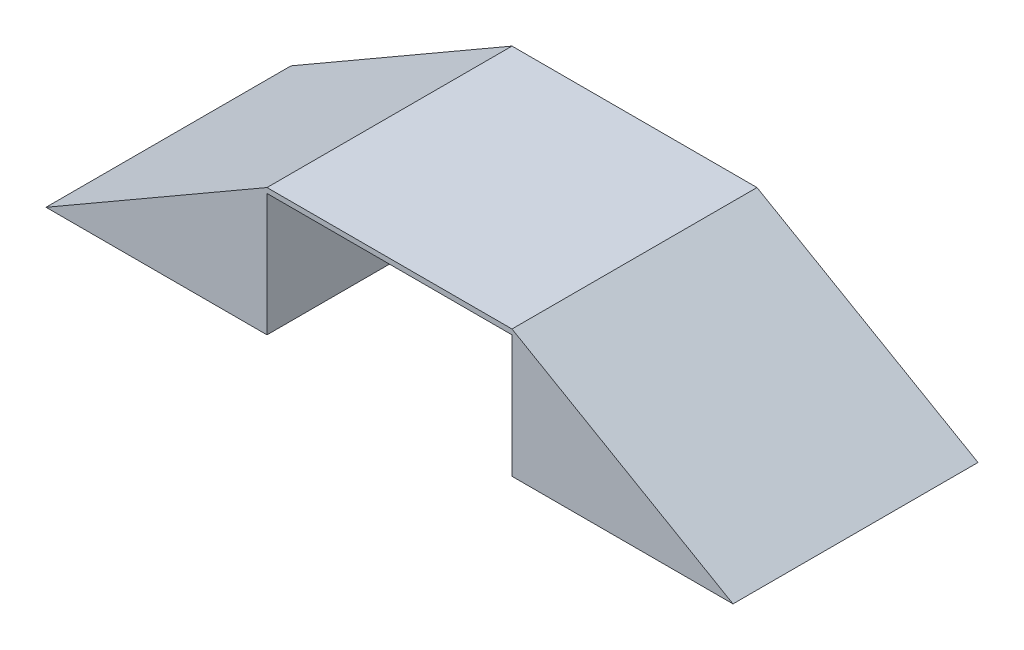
ISO-10303-21;
HEADER;
FILE_DESCRIPTION(('STEP AP214'),'2;1');
FILE_NAME('part.step','',(''),(''),'','','');
FILE_SCHEMA(('AUTOMOTIVE_DESIGN { 1 0 10303 214 1 1 1 1 }'));
ENDSEC;
DATA;
#1=APPLICATION_CONTEXT('core data for automotive mechanical design processes');
#2=APPLICATION_PROTOCOL_DEFINITION('international standard','automotive_design',2000,#1);
#3=PRODUCT_CONTEXT('',#1,'mechanical');
#4=PRODUCT('Part','Part','',(#3));
#5=PRODUCT_RELATED_PRODUCT_CATEGORY('part','',(#4));
#6=PRODUCT_DEFINITION_FORMATION('','',#4);
#7=PRODUCT_DEFINITION_CONTEXT('part definition',#1,'design');
#8=PRODUCT_DEFINITION('design','',#6,#7);
#9=PRODUCT_DEFINITION_SHAPE('','',#8);
#10=(LENGTH_UNIT() NAMED_UNIT(*) SI_UNIT(.MILLI.,.METRE.));
#11=(NAMED_UNIT(*) PLANE_ANGLE_UNIT() SI_UNIT($,.RADIAN.));
#12=(NAMED_UNIT(*) SI_UNIT($,.STERADIAN.) SOLID_ANGLE_UNIT());
#13=UNCERTAINTY_MEASURE_WITH_UNIT(LENGTH_MEASURE(1.E-05),#10,'distance_accuracy_value','');
#14=(GEOMETRIC_REPRESENTATION_CONTEXT(3) GLOBAL_UNCERTAINTY_ASSIGNED_CONTEXT((#13)) GLOBAL_UNIT_ASSIGNED_CONTEXT((#10,
#11,#12)) REPRESENTATION_CONTEXT('',''));
#15=CARTESIAN_POINT('',(0.,0.,0.));
#16=DIRECTION('',(0.,0.,1.));
#17=DIRECTION('',(1.,0.,0.));
#18=AXIS2_PLACEMENT_3D('',#15,#16,#17);
#19=CARTESIAN_POINT('',(854.726131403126,4.71031929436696E-13,304.8));
#20=DIRECTION('',(0.,1.,0.));
#21=DIRECTION('',(-1.,0.,0.));
#22=AXIS2_PLACEMENT_3D('',#19,#20,#21);
#23=PLANE('',#22);
#24=DIRECTION('',(1.,0.,0.));
#25=VECTOR('',#24,1.);
#26=CARTESIAN_POINT('',(854.726131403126,4.71031929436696E-13,-304.8));
#27=LINE('',#26,#25);
#28=CARTESIAN_POINT('',(-854.726131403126,2.61684405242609E-13,-304.8));
#29=VERTEX_POINT('',#28);
#30=CARTESIAN_POINT('',(-304.799999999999,2.61684405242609E-13,-304.8));
#31=VERTEX_POINT('',#30);
#32=EDGE_CURVE('E118',#29,#31,#27,.T.);
#33=ORIENTED_EDGE('',*,*,#32,.T.);
#34=DIRECTION('',(0.,0.,1.));
#35=VECTOR('',#34,1.);
#36=CARTESIAN_POINT('',(-304.799999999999,2.61684405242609E-13,-304.8));
#37=LINE('',#36,#35);
#38=CARTESIAN_POINT('',(-304.799999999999,2.61684405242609E-13,304.8));
#39=VERTEX_POINT('',#38);
#40=EDGE_CURVE('E106',#31,#39,#37,.T.);
#41=ORIENTED_EDGE('',*,*,#40,.T.);
#42=DIRECTION('',(1.,0.,0.));
#43=VECTOR('',#42,1.);
#44=CARTESIAN_POINT('',(854.726131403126,4.71031929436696E-13,304.8));
#45=LINE('',#44,#43);
#46=CARTESIAN_POINT('',(-854.726131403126,2.61684405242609E-13,304.8));
#47=VERTEX_POINT('',#46);
#48=EDGE_CURVE('E84',#47,#39,#45,.T.);
#49=ORIENTED_EDGE('',*,*,#48,.F.);
#50=DIRECTION('',(0.,0.,-1.));
#51=VECTOR('',#50,1.);
#52=CARTESIAN_POINT('',(-854.726131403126,2.61684405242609E-13,304.8));
#53=LINE('',#52,#51);
#54=EDGE_CURVE('E11',#47,#29,#53,.T.);
#55=ORIENTED_EDGE('',*,*,#54,.T.);
#56=EDGE_LOOP('',(#33,#41,#49,#55));
#57=FACE_BOUND('',#56,.T.);
#58=ADVANCED_FACE('F32',(#57),#23,.F.);
#59=CARTESIAN_POINT('',(-854.726131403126,2.61684405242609E-13,304.8));
#60=DIRECTION('',(0.499999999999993,-0.866025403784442,0.));
#61=DIRECTION('',(0.866025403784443,0.499999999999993,0.));
#62=AXIS2_PLACEMENT_3D('',#59,#60,#61);
#63=PLANE('',#62);
#64=DIRECTION('',(-0.866025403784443,-0.499999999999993,0.));
#65=VECTOR('',#64,1.);
#66=CARTESIAN_POINT('',(-854.726131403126,2.61684405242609E-13,-304.8));
#67=LINE('',#66,#65);
#68=CARTESIAN_POINT('',(-304.799999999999,317.499999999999,-304.8));
#69=VERTEX_POINT('',#68);
#70=EDGE_CURVE('E129',#69,#29,#67,.T.);
#71=ORIENTED_EDGE('',*,*,#70,.T.);
#72=ORIENTED_EDGE('',*,*,#54,.F.);
#73=DIRECTION('',(-0.866025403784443,-0.499999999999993,0.));
#74=VECTOR('',#73,1.);
#75=CARTESIAN_POINT('',(-854.726131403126,2.61684405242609E-13,304.8));
#76=LINE('',#75,#74);
#77=CARTESIAN_POINT('',(-304.799999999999,317.499999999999,304.8));
#78=VERTEX_POINT('',#77);
#79=EDGE_CURVE('E134',#78,#47,#76,.T.);
#80=ORIENTED_EDGE('',*,*,#79,.F.);
#81=DIRECTION('',(0.,0.,-1.));
#82=VECTOR('',#81,1.);
#83=CARTESIAN_POINT('',(-304.799999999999,317.499999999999,304.8));
#84=LINE('',#83,#82);
#85=EDGE_CURVE('E135',#78,#69,#84,.T.);
#86=ORIENTED_EDGE('',*,*,#85,.T.);
#87=EDGE_LOOP('',(#71,#72,#80,#86));
#88=FACE_BOUND('',#87,.T.);
#89=ADVANCED_FACE('F34',(#88),#63,.F.);
#90=CARTESIAN_POINT('',(304.800000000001,2.61684405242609E-13,304.8));
#91=VERTEX_POINT('',#90);
#92=CARTESIAN_POINT('',(854.726131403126,4.71031929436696E-13,304.8));
#93=VERTEX_POINT('',#92);
#94=EDGE_CURVE('E160',#91,#93,#45,.T.);
#95=ORIENTED_EDGE('',*,*,#94,.F.);
#96=DIRECTION('',(0.,0.,1.));
#97=VECTOR('',#96,1.);
#98=CARTESIAN_POINT('',(304.800000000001,2.61684405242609E-13,-304.8));
#99=LINE('',#98,#97);
#100=CARTESIAN_POINT('',(304.800000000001,2.61684405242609E-13,-304.8));
#101=VERTEX_POINT('',#100);
#102=EDGE_CURVE('E113',#101,#91,#99,.T.);
#103=ORIENTED_EDGE('',*,*,#102,.F.);
#104=CARTESIAN_POINT('',(854.726131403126,4.71031929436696E-13,-304.8));
#105=VERTEX_POINT('',#104);
#106=EDGE_CURVE('E126',#101,#105,#27,.T.);
#107=ORIENTED_EDGE('',*,*,#106,.T.);
#108=DIRECTION('',(0.,0.,-1.));
#109=VECTOR('',#108,1.);
#110=CARTESIAN_POINT('',(854.726131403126,4.71031929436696E-13,304.8));
#111=LINE('',#110,#109);
#112=EDGE_CURVE('E40',#93,#105,#111,.T.);
#113=ORIENTED_EDGE('',*,*,#112,.F.);
#114=EDGE_LOOP('',(#95,#103,#107,#113));
#115=FACE_BOUND('',#114,.T.);
#116=ADVANCED_FACE('F175',(#115),#23,.F.);
#117=CARTESIAN_POINT('',(304.800000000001,317.499999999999,304.8));
#118=DIRECTION('',(-0.499999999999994,-0.866025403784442,0.));
#119=DIRECTION('',(0.866025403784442,-0.499999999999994,0.));
#120=AXIS2_PLACEMENT_3D('',#117,#118,#119);
#121=PLANE('',#120);
#122=DIRECTION('',(-0.866025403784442,0.499999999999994,0.));
#123=VECTOR('',#122,1.);
#124=CARTESIAN_POINT('',(304.800000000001,317.499999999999,-304.8));
#125=LINE('',#124,#123);
#126=CARTESIAN_POINT('',(304.800000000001,317.499999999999,-304.8));
#127=VERTEX_POINT('',#126);
#128=EDGE_CURVE('E125',#105,#127,#125,.T.);
#129=ORIENTED_EDGE('',*,*,#128,.T.);
#130=DIRECTION('',(0.,0.,-1.));
#131=VECTOR('',#130,1.);
#132=CARTESIAN_POINT('',(304.800000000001,317.499999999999,304.8));
#133=LINE('',#132,#131);
#134=CARTESIAN_POINT('',(304.800000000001,317.499999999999,304.8));
#135=VERTEX_POINT('',#134);
#136=EDGE_CURVE('E137',#135,#127,#133,.T.);
#137=ORIENTED_EDGE('',*,*,#136,.F.);
#138=DIRECTION('',(-0.866025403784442,0.499999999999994,0.));
#139=VECTOR('',#138,1.);
#140=CARTESIAN_POINT('',(304.800000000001,317.499999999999,304.8));
#141=LINE('',#140,#139);
#142=EDGE_CURVE('E145',#93,#135,#141,.T.);
#143=ORIENTED_EDGE('',*,*,#142,.F.);
#144=ORIENTED_EDGE('',*,*,#112,.T.);
#145=EDGE_LOOP('',(#129,#137,#143,#144));
#146=FACE_BOUND('',#145,.T.);
#147=ADVANCED_FACE('F143',(#146),#121,.F.);
#148=CARTESIAN_POINT('',(-304.799999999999,317.499999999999,304.8));
#149=DIRECTION('',(0.,-1.,0.));
#150=DIRECTION('',(1.,0.,0.));
#151=AXIS2_PLACEMENT_3D('',#148,#149,#150);
#152=PLANE('',#151);
#153=DIRECTION('',(-1.,0.,0.));
#154=VECTOR('',#153,1.);
#155=CARTESIAN_POINT('',(-304.799999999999,317.499999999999,-304.8));
#156=LINE('',#155,#154);
#157=EDGE_CURVE('E77',#127,#69,#156,.T.);
#158=ORIENTED_EDGE('',*,*,#157,.T.);
#159=ORIENTED_EDGE('',*,*,#85,.F.);
#160=DIRECTION('',(-1.,0.,0.));
#161=VECTOR('',#160,1.);
#162=CARTESIAN_POINT('',(-304.799999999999,317.499999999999,304.8));
#163=LINE('',#162,#161);
#164=EDGE_CURVE('E56',#135,#78,#163,.T.);
#165=ORIENTED_EDGE('',*,*,#164,.F.);
#166=ORIENTED_EDGE('',*,*,#136,.T.);
#167=EDGE_LOOP('',(#158,#159,#165,#166));
#168=FACE_BOUND('',#167,.T.);
#169=ADVANCED_FACE('F164',(#168),#152,.F.);
#170=CARTESIAN_POINT('',(0.,0.,304.8));
#171=DIRECTION('',(0.,0.,-1.));
#172=DIRECTION('',(-1.,0.,0.));
#173=AXIS2_PLACEMENT_3D('',#170,#171,#172);
#174=PLANE('',#173);
#175=ORIENTED_EDGE('',*,*,#48,.T.);
#176=DIRECTION('',(0.,-1.,0.));
#177=VECTOR('',#176,1.);
#178=CARTESIAN_POINT('',(-304.799999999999,2.61684405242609E-13,304.8));
#179=LINE('',#178,#177);
#180=CARTESIAN_POINT('',(-304.799999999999,304.799999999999,304.8));
#181=VERTEX_POINT('',#180);
#182=EDGE_CURVE('E111',#181,#39,#179,.T.);
#183=ORIENTED_EDGE('',*,*,#182,.F.);
#184=DIRECTION('',(-1.,0.,0.));
#185=VECTOR('',#184,1.);
#186=CARTESIAN_POINT('',(-304.799999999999,304.799999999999,304.8));
#187=LINE('',#186,#185);
#188=CARTESIAN_POINT('',(304.800000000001,304.799999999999,304.8));
#189=VERTEX_POINT('',#188);
#190=EDGE_CURVE('E121',#189,#181,#187,.T.);
#191=ORIENTED_EDGE('',*,*,#190,.F.);
#192=DIRECTION('',(0.,1.,0.));
#193=VECTOR('',#192,1.);
#194=CARTESIAN_POINT('',(304.800000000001,2.61684405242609E-13,304.8));
#195=LINE('',#194,#193);
#196=EDGE_CURVE('E167',#91,#189,#195,.T.);
#197=ORIENTED_EDGE('',*,*,#196,.F.);
#198=ORIENTED_EDGE('',*,*,#94,.T.);
#199=ORIENTED_EDGE('',*,*,#142,.T.);
#200=ORIENTED_EDGE('',*,*,#164,.T.);
#201=ORIENTED_EDGE('',*,*,#79,.T.);
#202=EDGE_LOOP('',(#175,#183,#191,#197,#198,#199,#200,#201));
#203=FACE_BOUND('',#202,.T.);
#204=ADVANCED_FACE('F162',(#203),#174,.F.);
#205=CARTESIAN_POINT('',(0.,0.,-304.8));
#206=DIRECTION('',(0.,0.,-1.));
#207=DIRECTION('',(-1.,0.,0.));
#208=AXIS2_PLACEMENT_3D('',#205,#206,#207);
#209=PLANE('',#208);
#210=DIRECTION('',(0.,-1.,0.));
#211=VECTOR('',#210,1.);
#212=CARTESIAN_POINT('',(-304.799999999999,2.61684405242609E-13,-304.8));
#213=LINE('',#212,#211);
#214=CARTESIAN_POINT('',(-304.799999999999,304.799999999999,-304.8));
#215=VERTEX_POINT('',#214);
#216=EDGE_CURVE('E109',#215,#31,#213,.T.);
#217=ORIENTED_EDGE('',*,*,#216,.T.);
#218=ORIENTED_EDGE('',*,*,#32,.F.);
#219=ORIENTED_EDGE('',*,*,#70,.F.);
#220=ORIENTED_EDGE('',*,*,#157,.F.);
#221=ORIENTED_EDGE('',*,*,#128,.F.);
#222=ORIENTED_EDGE('',*,*,#106,.F.);
#223=DIRECTION('',(0.,1.,0.));
#224=VECTOR('',#223,1.);
#225=CARTESIAN_POINT('',(304.800000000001,2.61684405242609E-13,-304.8));
#226=LINE('',#225,#224);
#227=CARTESIAN_POINT('',(304.800000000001,304.799999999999,-304.8));
#228=VERTEX_POINT('',#227);
#229=EDGE_CURVE('E120',#101,#228,#226,.T.);
#230=ORIENTED_EDGE('',*,*,#229,.T.);
#231=DIRECTION('',(-1.,0.,0.));
#232=VECTOR('',#231,1.);
#233=CARTESIAN_POINT('',(-304.799999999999,304.799999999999,-304.8));
#234=LINE('',#233,#232);
#235=EDGE_CURVE('E47',#228,#215,#234,.T.);
#236=ORIENTED_EDGE('',*,*,#235,.T.);
#237=EDGE_LOOP('',(#217,#218,#219,#220,#221,#222,#230,#236));
#238=FACE_BOUND('',#237,.T.);
#239=ADVANCED_FACE('F116',(#238),#209,.T.);
#240=CARTESIAN_POINT('',(-304.799999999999,2.61684405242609E-13,-304.8));
#241=DIRECTION('',(-1.,0.,0.));
#242=DIRECTION('',(0.,0.,1.));
#243=AXIS2_PLACEMENT_3D('',#240,#241,#242);
#244=PLANE('',#243);
#245=ORIENTED_EDGE('',*,*,#182,.T.);
#246=ORIENTED_EDGE('',*,*,#40,.F.);
#247=ORIENTED_EDGE('',*,*,#216,.F.);
#248=DIRECTION('',(0.,0.,1.));
#249=VECTOR('',#248,1.);
#250=CARTESIAN_POINT('',(-304.799999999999,304.799999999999,-304.8));
#251=LINE('',#250,#249);
#252=EDGE_CURVE('E150',#215,#181,#251,.T.);
#253=ORIENTED_EDGE('',*,*,#252,.T.);
#254=EDGE_LOOP('',(#245,#246,#247,#253));
#255=FACE_BOUND('',#254,.T.);
#256=ADVANCED_FACE('F108',(#255),#244,.F.);
#257=CARTESIAN_POINT('',(-304.799999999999,304.799999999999,-304.8));
#258=DIRECTION('',(0.,1.,0.));
#259=DIRECTION('',(0.,0.,1.));
#260=AXIS2_PLACEMENT_3D('',#257,#258,#259);
#261=PLANE('',#260);
#262=ORIENTED_EDGE('',*,*,#190,.T.);
#263=ORIENTED_EDGE('',*,*,#252,.F.);
#264=ORIENTED_EDGE('',*,*,#235,.F.);
#265=DIRECTION('',(0.,0.,1.));
#266=VECTOR('',#265,1.);
#267=CARTESIAN_POINT('',(304.800000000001,304.799999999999,-304.8));
#268=LINE('',#267,#266);
#269=EDGE_CURVE('E151',#228,#189,#268,.T.);
#270=ORIENTED_EDGE('',*,*,#269,.T.);
#271=EDGE_LOOP('',(#262,#263,#264,#270));
#272=FACE_BOUND('',#271,.T.);
#273=ADVANCED_FACE('F224',(#272),#261,.F.);
#274=CARTESIAN_POINT('',(304.800000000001,2.61684405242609E-13,-304.8));
#275=DIRECTION('',(1.,0.,0.));
#276=DIRECTION('',(0.,0.,-1.));
#277=AXIS2_PLACEMENT_3D('',#274,#275,#276);
#278=PLANE('',#277);
#279=ORIENTED_EDGE('',*,*,#196,.T.);
#280=ORIENTED_EDGE('',*,*,#269,.F.);
#281=ORIENTED_EDGE('',*,*,#229,.F.);
#282=ORIENTED_EDGE('',*,*,#102,.T.);
#283=EDGE_LOOP('',(#279,#280,#281,#282));
#284=FACE_BOUND('',#283,.T.);
#285=ADVANCED_FACE('F174',(#284),#278,.F.);
#286=CLOSED_SHELL('',(#58,#89,#116,#147,#169,#204,#239,#256,#273,#285));
#287=MANIFOLD_SOLID_BREP('B2',#286);
#288=ADVANCED_BREP_SHAPE_REPRESENTATION('',(#18,#287),#14);
#289=SHAPE_DEFINITION_REPRESENTATION(#9,#288);
ENDSEC;
END-ISO-10303-21;
